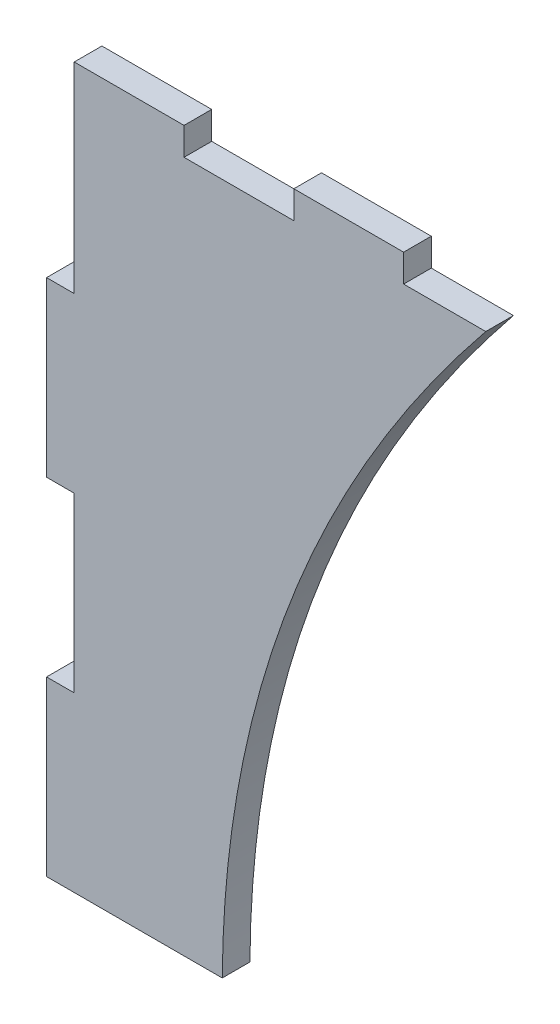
ISO-10303-21;
HEADER;
FILE_DESCRIPTION(('STEP AP214'),'2;1');
FILE_NAME('part.step','',(''),(''),'','','');
FILE_SCHEMA(('AUTOMOTIVE_DESIGN { 1 0 10303 214 1 1 1 1 }'));
ENDSEC;
DATA;
#1=APPLICATION_CONTEXT('core data for automotive mechanical design processes');
#2=APPLICATION_PROTOCOL_DEFINITION('international standard','automotive_design',2000,#1);
#3=PRODUCT_CONTEXT('',#1,'mechanical');
#4=PRODUCT('Part','Part','',(#3));
#5=PRODUCT_RELATED_PRODUCT_CATEGORY('part','',(#4));
#6=PRODUCT_DEFINITION_FORMATION('','',#4);
#7=PRODUCT_DEFINITION_CONTEXT('part definition',#1,'design');
#8=PRODUCT_DEFINITION('design','',#6,#7);
#9=PRODUCT_DEFINITION_SHAPE('','',#8);
#10=(LENGTH_UNIT() NAMED_UNIT(*) SI_UNIT(.MILLI.,.METRE.));
#11=(NAMED_UNIT(*) PLANE_ANGLE_UNIT() SI_UNIT($,.RADIAN.));
#12=(NAMED_UNIT(*) SI_UNIT($,.STERADIAN.) SOLID_ANGLE_UNIT());
#13=UNCERTAINTY_MEASURE_WITH_UNIT(LENGTH_MEASURE(1.E-05),#10,'distance_accuracy_value','');
#14=(GEOMETRIC_REPRESENTATION_CONTEXT(3) GLOBAL_UNCERTAINTY_ASSIGNED_CONTEXT((#13)) GLOBAL_UNIT_ASSIGNED_CONTEXT((#10,
#11,#12)) REPRESENTATION_CONTEXT('',''));
#15=CARTESIAN_POINT('',(0.,0.,0.));
#16=DIRECTION('',(0.,0.,1.));
#17=DIRECTION('',(1.,0.,0.));
#18=AXIS2_PLACEMENT_3D('',#15,#16,#17);
#19=CARTESIAN_POINT('',(0.,100.,16.));
#20=DIRECTION('',(1.,0.,0.));
#21=DIRECTION('',(0.,0.,-1.));
#22=AXIS2_PLACEMENT_3D('',#19,#20,#21);
#23=PLANE('',#22);
#24=DIRECTION('',(0.,-1.,0.));
#25=VECTOR('',#24,1.);
#26=CARTESIAN_POINT('',(0.,100.,0.));
#27=LINE('',#26,#25);
#28=CARTESIAN_POINT('',(0.,100.,0.));
#29=VERTEX_POINT('',#28);
#30=CARTESIAN_POINT('',(0.,0.,0.));
#31=VERTEX_POINT('',#30);
#32=EDGE_CURVE('E177',#29,#31,#27,.T.);
#33=ORIENTED_EDGE('',*,*,#32,.T.);
#34=DIRECTION('',(0.,0.,-1.));
#35=VECTOR('',#34,1.);
#36=CARTESIAN_POINT('',(0.,0.,16.));
#37=LINE('',#36,#35);
#38=CARTESIAN_POINT('',(0.,0.,16.));
#39=VERTEX_POINT('',#38);
#40=EDGE_CURVE('E11',#39,#31,#37,.T.);
#41=ORIENTED_EDGE('',*,*,#40,.F.);
#42=DIRECTION('',(0.,-1.,0.));
#43=VECTOR('',#42,1.);
#44=CARTESIAN_POINT('',(0.,100.,16.));
#45=LINE('',#44,#43);
#46=CARTESIAN_POINT('',(0.,100.,16.));
#47=VERTEX_POINT('',#46);
#48=EDGE_CURVE('E212',#47,#39,#45,.T.);
#49=ORIENTED_EDGE('',*,*,#48,.F.);
#50=DIRECTION('',(0.,0.,-1.));
#51=VECTOR('',#50,1.);
#52=CARTESIAN_POINT('',(0.,100.,16.));
#53=LINE('',#52,#51);
#54=EDGE_CURVE('E173',#47,#29,#53,.T.);
#55=ORIENTED_EDGE('',*,*,#54,.T.);
#56=EDGE_LOOP('',(#33,#41,#49,#55));
#57=FACE_BOUND('',#56,.T.);
#58=ADVANCED_FACE('F33',(#57),#23,.F.);
#59=CARTESIAN_POINT('',(0.,0.,16.));
#60=DIRECTION('',(0.,1.,0.));
#61=DIRECTION('',(0.,0.,1.));
#62=AXIS2_PLACEMENT_3D('',#59,#60,#61);
#63=PLANE('',#62);
#64=DIRECTION('',(1.,0.,0.));
#65=VECTOR('',#64,1.);
#66=CARTESIAN_POINT('',(0.,0.,0.));
#67=LINE('',#66,#65);
#68=CARTESIAN_POINT('',(101.6,0.,0.));
#69=VERTEX_POINT('',#68);
#70=EDGE_CURVE('E180',#31,#69,#67,.T.);
#71=ORIENTED_EDGE('',*,*,#70,.T.);
#72=DIRECTION('',(0.,0.,-1.));
#73=VECTOR('',#72,1.);
#74=CARTESIAN_POINT('',(101.6,0.,16.));
#75=LINE('',#74,#73);
#76=CARTESIAN_POINT('',(101.6,0.,16.));
#77=VERTEX_POINT('',#76);
#78=EDGE_CURVE('E41',#77,#69,#75,.T.);
#79=ORIENTED_EDGE('',*,*,#78,.F.);
#80=DIRECTION('',(1.,0.,0.));
#81=VECTOR('',#80,1.);
#82=CARTESIAN_POINT('',(0.,0.,16.));
#83=LINE('',#82,#81);
#84=EDGE_CURVE('E116',#39,#77,#83,.T.);
#85=ORIENTED_EDGE('',*,*,#84,.F.);
#86=ORIENTED_EDGE('',*,*,#40,.T.);
#87=EDGE_LOOP('',(#71,#79,#85,#86));
#88=FACE_BOUND('',#87,.T.);
#89=ADVANCED_FACE('F310',(#88),#63,.F.);
#90=CARTESIAN_POINT('',(101.6,0.,16.));
#91=CARTESIAN_POINT('',(103.225203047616,213.725277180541,16.));
#92=CARTESIAN_POINT('',(254.,400.,16.));
#93=B_SPLINE_CURVE_WITH_KNOTS('',2,(#90,#91,#92),.UNSPECIFIED.,.F.,.F.,(3,3),(0.,
0.978671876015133),.UNSPECIFIED.);
#94=DIRECTION('',(0.,0.,-1.));
#95=VECTOR('',#94,1.);
#96=SURFACE_OF_LINEAR_EXTRUSION('',#93,#95);
#97=CARTESIAN_POINT('',(101.6,0.,0.));
#98=CARTESIAN_POINT('',(103.225203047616,213.725277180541,0.));
#99=CARTESIAN_POINT('',(254.,400.,0.));
#100=B_SPLINE_CURVE_WITH_KNOTS('',2,(#97,#98,#99),.UNSPECIFIED.,.F.,.F.,(3,3),(0.,
0.978671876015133),.UNSPECIFIED.);
#101=CARTESIAN_POINT('',(254.,400.,0.));
#102=VERTEX_POINT('',#101);
#103=EDGE_CURVE('E182',#69,#102,#100,.T.);
#104=ORIENTED_EDGE('',*,*,#103,.T.);
#105=DIRECTION('',(0.,0.,-1.));
#106=VECTOR('',#105,1.);
#107=CARTESIAN_POINT('',(254.,400.,16.));
#108=LINE('',#107,#106);
#109=CARTESIAN_POINT('',(254.,400.,16.));
#110=VERTEX_POINT('',#109);
#111=EDGE_CURVE('E243',#110,#102,#108,.T.);
#112=ORIENTED_EDGE('',*,*,#111,.F.);
#113=EDGE_CURVE('E251',#77,#110,#93,.T.);
#114=ORIENTED_EDGE('',*,*,#113,.F.);
#115=ORIENTED_EDGE('',*,*,#78,.T.);
#116=EDGE_LOOP('',(#104,#112,#114,#115));
#117=FACE_BOUND('',#116,.T.);
#118=ADVANCED_FACE('F249',(#117),#96,.F.);
#119=CARTESIAN_POINT('',(206.5,400.,16.));
#120=DIRECTION('',(0.,-1.,0.));
#121=DIRECTION('',(0.,0.,-1.));
#122=AXIS2_PLACEMENT_3D('',#119,#120,#121);
#123=PLANE('',#122);
#124=DIRECTION('',(-1.,0.,0.));
#125=VECTOR('',#124,1.);
#126=CARTESIAN_POINT('',(206.5,400.,0.));
#127=LINE('',#126,#125);
#128=CARTESIAN_POINT('',(206.5,400.,0.));
#129=VERTEX_POINT('',#128);
#130=EDGE_CURVE('E186',#102,#129,#127,.T.);
#131=ORIENTED_EDGE('',*,*,#130,.T.);
#132=DIRECTION('',(0.,0.,-1.));
#133=VECTOR('',#132,1.);
#134=CARTESIAN_POINT('',(206.5,400.,16.));
#135=LINE('',#134,#133);
#136=CARTESIAN_POINT('',(206.5,400.,16.));
#137=VERTEX_POINT('',#136);
#138=EDGE_CURVE('E240',#137,#129,#135,.T.);
#139=ORIENTED_EDGE('',*,*,#138,.F.);
#140=DIRECTION('',(-1.,0.,0.));
#141=VECTOR('',#140,1.);
#142=CARTESIAN_POINT('',(206.5,400.,16.));
#143=LINE('',#142,#141);
#144=EDGE_CURVE('E269',#110,#137,#143,.T.);
#145=ORIENTED_EDGE('',*,*,#144,.F.);
#146=ORIENTED_EDGE('',*,*,#111,.T.);
#147=EDGE_LOOP('',(#131,#139,#145,#146));
#148=FACE_BOUND('',#147,.T.);
#149=ADVANCED_FACE('F260',(#148),#123,.F.);
#150=CARTESIAN_POINT('',(206.5,416.,16.));
#151=DIRECTION('',(-1.,0.,0.));
#152=DIRECTION('',(0.,-1.,0.));
#153=AXIS2_PLACEMENT_3D('',#150,#151,#152);
#154=PLANE('',#153);
#155=DIRECTION('',(0.,1.,0.));
#156=VECTOR('',#155,1.);
#157=CARTESIAN_POINT('',(206.5,416.,0.));
#158=LINE('',#157,#156);
#159=CARTESIAN_POINT('',(206.5,416.,0.));
#160=VERTEX_POINT('',#159);
#161=EDGE_CURVE('E191',#129,#160,#158,.T.);
#162=ORIENTED_EDGE('',*,*,#161,.T.);
#163=DIRECTION('',(0.,0.,-1.));
#164=VECTOR('',#163,1.);
#165=CARTESIAN_POINT('',(206.5,416.,16.));
#166=LINE('',#165,#164);
#167=CARTESIAN_POINT('',(206.5,416.,16.));
#168=VERTEX_POINT('',#167);
#169=EDGE_CURVE('E237',#168,#160,#166,.T.);
#170=ORIENTED_EDGE('',*,*,#169,.F.);
#171=DIRECTION('',(0.,1.,0.));
#172=VECTOR('',#171,1.);
#173=CARTESIAN_POINT('',(206.5,416.,16.));
#174=LINE('',#173,#172);
#175=EDGE_CURVE('E266',#137,#168,#174,.T.);
#176=ORIENTED_EDGE('',*,*,#175,.F.);
#177=ORIENTED_EDGE('',*,*,#138,.T.);
#178=EDGE_LOOP('',(#162,#170,#176,#177));
#179=FACE_BOUND('',#178,.T.);
#180=ADVANCED_FACE('F264',(#179),#154,.F.);
#181=CARTESIAN_POINT('',(143.,416.,16.));
#182=DIRECTION('',(0.,-1.,0.));
#183=DIRECTION('',(0.,0.,-1.));
#184=AXIS2_PLACEMENT_3D('',#181,#182,#183);
#185=PLANE('',#184);
#186=DIRECTION('',(-1.,0.,0.));
#187=VECTOR('',#186,1.);
#188=CARTESIAN_POINT('',(143.,416.,0.));
#189=LINE('',#188,#187);
#190=CARTESIAN_POINT('',(143.,416.,0.));
#191=VERTEX_POINT('',#190);
#192=EDGE_CURVE('E193',#160,#191,#189,.T.);
#193=ORIENTED_EDGE('',*,*,#192,.T.);
#194=DIRECTION('',(0.,0.,-1.));
#195=VECTOR('',#194,1.);
#196=CARTESIAN_POINT('',(143.,416.,16.));
#197=LINE('',#196,#195);
#198=CARTESIAN_POINT('',(143.,416.,16.));
#199=VERTEX_POINT('',#198);
#200=EDGE_CURVE('E234',#199,#191,#197,.T.);
#201=ORIENTED_EDGE('',*,*,#200,.F.);
#202=DIRECTION('',(-1.,0.,0.));
#203=VECTOR('',#202,1.);
#204=CARTESIAN_POINT('',(143.,416.,16.));
#205=LINE('',#204,#203);
#206=EDGE_CURVE('E268',#168,#199,#205,.T.);
#207=ORIENTED_EDGE('',*,*,#206,.F.);
#208=ORIENTED_EDGE('',*,*,#169,.T.);
#209=EDGE_LOOP('',(#193,#201,#207,#208));
#210=FACE_BOUND('',#209,.T.);
#211=ADVANCED_FACE('F331',(#210),#185,.F.);
#212=CARTESIAN_POINT('',(143.,400.,16.));
#213=DIRECTION('',(1.,0.,0.));
#214=DIRECTION('',(0.,0.,-1.));
#215=AXIS2_PLACEMENT_3D('',#212,#213,#214);
#216=PLANE('',#215);
#217=DIRECTION('',(0.,-1.,0.));
#218=VECTOR('',#217,1.);
#219=CARTESIAN_POINT('',(143.,400.,0.));
#220=LINE('',#219,#218);
#221=CARTESIAN_POINT('',(143.,400.,0.));
#222=VERTEX_POINT('',#221);
#223=EDGE_CURVE('E195',#191,#222,#220,.T.);
#224=ORIENTED_EDGE('',*,*,#223,.T.);
#225=DIRECTION('',(0.,0.,-1.));
#226=VECTOR('',#225,1.);
#227=CARTESIAN_POINT('',(143.,400.,16.));
#228=LINE('',#227,#226);
#229=CARTESIAN_POINT('',(143.,400.,16.));
#230=VERTEX_POINT('',#229);
#231=EDGE_CURVE('E231',#230,#222,#228,.T.);
#232=ORIENTED_EDGE('',*,*,#231,.F.);
#233=DIRECTION('',(0.,-1.,0.));
#234=VECTOR('',#233,1.);
#235=CARTESIAN_POINT('',(143.,400.,16.));
#236=LINE('',#235,#234);
#237=EDGE_CURVE('E271',#199,#230,#236,.T.);
#238=ORIENTED_EDGE('',*,*,#237,.F.);
#239=ORIENTED_EDGE('',*,*,#200,.T.);
#240=EDGE_LOOP('',(#224,#232,#238,#239));
#241=FACE_BOUND('',#240,.T.);
#242=ADVANCED_FACE('F334',(#241),#216,.F.);
#243=CARTESIAN_POINT('',(79.5,400.,16.));
#244=DIRECTION('',(0.,-1.,0.));
#245=DIRECTION('',(0.,0.,-1.));
#246=AXIS2_PLACEMENT_3D('',#243,#244,#245);
#247=PLANE('',#246);
#248=DIRECTION('',(-1.,0.,0.));
#249=VECTOR('',#248,1.);
#250=CARTESIAN_POINT('',(79.5,400.,0.));
#251=LINE('',#250,#249);
#252=CARTESIAN_POINT('',(79.5,400.,0.));
#253=VERTEX_POINT('',#252);
#254=EDGE_CURVE('E197',#222,#253,#251,.T.);
#255=ORIENTED_EDGE('',*,*,#254,.T.);
#256=DIRECTION('',(0.,0.,-1.));
#257=VECTOR('',#256,1.);
#258=CARTESIAN_POINT('',(79.5,400.,16.));
#259=LINE('',#258,#257);
#260=CARTESIAN_POINT('',(79.5,400.,16.));
#261=VERTEX_POINT('',#260);
#262=EDGE_CURVE('E228',#261,#253,#259,.T.);
#263=ORIENTED_EDGE('',*,*,#262,.F.);
#264=DIRECTION('',(-1.,0.,0.));
#265=VECTOR('',#264,1.);
#266=CARTESIAN_POINT('',(79.5,400.,16.));
#267=LINE('',#266,#265);
#268=EDGE_CURVE('E277',#230,#261,#267,.T.);
#269=ORIENTED_EDGE('',*,*,#268,.F.);
#270=ORIENTED_EDGE('',*,*,#231,.T.);
#271=EDGE_LOOP('',(#255,#263,#269,#270));
#272=FACE_BOUND('',#271,.T.);
#273=ADVANCED_FACE('F338',(#272),#247,.F.);
#274=CARTESIAN_POINT('',(79.5,416.,16.));
#275=DIRECTION('',(-1.,0.,0.));
#276=DIRECTION('',(0.,0.,1.));
#277=AXIS2_PLACEMENT_3D('',#274,#275,#276);
#278=PLANE('',#277);
#279=DIRECTION('',(0.,1.,0.));
#280=VECTOR('',#279,1.);
#281=CARTESIAN_POINT('',(79.5,416.,0.));
#282=LINE('',#281,#280);
#283=CARTESIAN_POINT('',(79.5,416.,0.));
#284=VERTEX_POINT('',#283);
#285=EDGE_CURVE('E199',#253,#284,#282,.T.);
#286=ORIENTED_EDGE('',*,*,#285,.T.);
#287=DIRECTION('',(0.,0.,-1.));
#288=VECTOR('',#287,1.);
#289=CARTESIAN_POINT('',(79.5,416.,16.));
#290=LINE('',#289,#288);
#291=CARTESIAN_POINT('',(79.5,416.,16.));
#292=VERTEX_POINT('',#291);
#293=EDGE_CURVE('E225',#292,#284,#290,.T.);
#294=ORIENTED_EDGE('',*,*,#293,.F.);
#295=DIRECTION('',(0.,1.,0.));
#296=VECTOR('',#295,1.);
#297=CARTESIAN_POINT('',(79.5,416.,16.));
#298=LINE('',#297,#296);
#299=EDGE_CURVE('E279',#261,#292,#298,.T.);
#300=ORIENTED_EDGE('',*,*,#299,.F.);
#301=ORIENTED_EDGE('',*,*,#262,.T.);
#302=EDGE_LOOP('',(#286,#294,#300,#301));
#303=FACE_BOUND('',#302,.T.);
#304=ADVANCED_FACE('F342',(#303),#278,.F.);
#305=CARTESIAN_POINT('',(79.5,416.,16.));
#306=DIRECTION('',(0.,-1.,0.));
#307=DIRECTION('',(0.,0.,-1.));
#308=AXIS2_PLACEMENT_3D('',#305,#306,#307);
#309=PLANE('',#308);
#310=DIRECTION('',(-1.,0.,0.));
#311=VECTOR('',#310,1.);
#312=CARTESIAN_POINT('',(79.5,416.,0.));
#313=LINE('',#312,#311);
#314=CARTESIAN_POINT('',(16.,416.,0.));
#315=VERTEX_POINT('',#314);
#316=EDGE_CURVE('E201',#284,#315,#313,.T.);
#317=ORIENTED_EDGE('',*,*,#316,.T.);
#318=DIRECTION('',(0.,0.,-1.));
#319=VECTOR('',#318,1.);
#320=CARTESIAN_POINT('',(16.,416.,16.));
#321=LINE('',#320,#319);
#322=CARTESIAN_POINT('',(16.,416.,16.));
#323=VERTEX_POINT('',#322);
#324=EDGE_CURVE('E222',#323,#315,#321,.T.);
#325=ORIENTED_EDGE('',*,*,#324,.F.);
#326=DIRECTION('',(-1.,0.,0.));
#327=VECTOR('',#326,1.);
#328=CARTESIAN_POINT('',(79.5,416.,16.));
#329=LINE('',#328,#327);
#330=EDGE_CURVE('E281',#292,#323,#329,.T.);
#331=ORIENTED_EDGE('',*,*,#330,.F.);
#332=ORIENTED_EDGE('',*,*,#293,.T.);
#333=EDGE_LOOP('',(#317,#325,#331,#332));
#334=FACE_BOUND('',#333,.T.);
#335=ADVANCED_FACE('F346',(#334),#309,.F.);
#336=CARTESIAN_POINT('',(16.,300.,16.));
#337=DIRECTION('',(1.,0.,0.));
#338=DIRECTION('',(0.,1.,0.));
#339=AXIS2_PLACEMENT_3D('',#336,#337,#338);
#340=PLANE('',#339);
#341=DIRECTION('',(0.,-1.,0.));
#342=VECTOR('',#341,1.);
#343=CARTESIAN_POINT('',(16.,300.,0.));
#344=LINE('',#343,#342);
#345=CARTESIAN_POINT('',(16.,300.,0.));
#346=VERTEX_POINT('',#345);
#347=EDGE_CURVE('E203',#315,#346,#344,.T.);
#348=ORIENTED_EDGE('',*,*,#347,.T.);
#349=DIRECTION('',(0.,0.,-1.));
#350=VECTOR('',#349,1.);
#351=CARTESIAN_POINT('',(16.,300.,16.));
#352=LINE('',#351,#350);
#353=CARTESIAN_POINT('',(16.,300.,16.));
#354=VERTEX_POINT('',#353);
#355=EDGE_CURVE('E219',#354,#346,#352,.T.);
#356=ORIENTED_EDGE('',*,*,#355,.F.);
#357=DIRECTION('',(0.,-1.,0.));
#358=VECTOR('',#357,1.);
#359=CARTESIAN_POINT('',(16.,300.,16.));
#360=LINE('',#359,#358);
#361=EDGE_CURVE('E283',#323,#354,#360,.T.);
#362=ORIENTED_EDGE('',*,*,#361,.F.);
#363=ORIENTED_EDGE('',*,*,#324,.T.);
#364=EDGE_LOOP('',(#348,#356,#362,#363));
#365=FACE_BOUND('',#364,.T.);
#366=ADVANCED_FACE('F350',(#365),#340,.F.);
#367=CARTESIAN_POINT('',(0.,300.,16.));
#368=DIRECTION('',(0.,-1.,0.));
#369=DIRECTION('',(0.,0.,-1.));
#370=AXIS2_PLACEMENT_3D('',#367,#368,#369);
#371=PLANE('',#370);
#372=DIRECTION('',(-1.,0.,0.));
#373=VECTOR('',#372,1.);
#374=CARTESIAN_POINT('',(0.,300.,0.));
#375=LINE('',#374,#373);
#376=CARTESIAN_POINT('',(0.,300.,0.));
#377=VERTEX_POINT('',#376);
#378=EDGE_CURVE('E205',#346,#377,#375,.T.);
#379=ORIENTED_EDGE('',*,*,#378,.T.);
#380=DIRECTION('',(0.,0.,-1.));
#381=VECTOR('',#380,1.);
#382=CARTESIAN_POINT('',(0.,300.,16.));
#383=LINE('',#382,#381);
#384=CARTESIAN_POINT('',(0.,300.,16.));
#385=VERTEX_POINT('',#384);
#386=EDGE_CURVE('E216',#385,#377,#383,.T.);
#387=ORIENTED_EDGE('',*,*,#386,.F.);
#388=DIRECTION('',(-1.,0.,0.));
#389=VECTOR('',#388,1.);
#390=CARTESIAN_POINT('',(0.,300.,16.));
#391=LINE('',#390,#389);
#392=EDGE_CURVE('E285',#354,#385,#391,.T.);
#393=ORIENTED_EDGE('',*,*,#392,.F.);
#394=ORIENTED_EDGE('',*,*,#355,.T.);
#395=EDGE_LOOP('',(#379,#387,#393,#394));
#396=FACE_BOUND('',#395,.T.);
#397=ADVANCED_FACE('F291',(#396),#371,.F.);
#398=CARTESIAN_POINT('',(0.,300.,16.));
#399=DIRECTION('',(1.,0.,0.));
#400=DIRECTION('',(0.,0.,-1.));
#401=AXIS2_PLACEMENT_3D('',#398,#399,#400);
#402=PLANE('',#401);
#403=DIRECTION('',(0.,-1.,0.));
#404=VECTOR('',#403,1.);
#405=CARTESIAN_POINT('',(0.,300.,0.));
#406=LINE('',#405,#404);
#407=CARTESIAN_POINT('',(0.,200.,0.));
#408=VERTEX_POINT('',#407);
#409=EDGE_CURVE('E207',#377,#408,#406,.T.);
#410=ORIENTED_EDGE('',*,*,#409,.T.);
#411=DIRECTION('',(0.,0.,-1.));
#412=VECTOR('',#411,1.);
#413=CARTESIAN_POINT('',(0.,200.,16.));
#414=LINE('',#413,#412);
#415=CARTESIAN_POINT('',(0.,200.,16.));
#416=VERTEX_POINT('',#415);
#417=EDGE_CURVE('E168',#416,#408,#414,.T.);
#418=ORIENTED_EDGE('',*,*,#417,.F.);
#419=DIRECTION('',(0.,-1.,0.));
#420=VECTOR('',#419,1.);
#421=CARTESIAN_POINT('',(0.,300.,16.));
#422=LINE('',#421,#420);
#423=EDGE_CURVE('E159',#385,#416,#422,.T.);
#424=ORIENTED_EDGE('',*,*,#423,.F.);
#425=ORIENTED_EDGE('',*,*,#386,.T.);
#426=EDGE_LOOP('',(#410,#418,#424,#425));
#427=FACE_BOUND('',#426,.T.);
#428=ADVANCED_FACE('F295',(#427),#402,.F.);
#429=CARTESIAN_POINT('',(16.,200.,16.));
#430=DIRECTION('',(0.,1.,0.));
#431=DIRECTION('',(-1.,0.,0.));
#432=AXIS2_PLACEMENT_3D('',#429,#430,#431);
#433=PLANE('',#432);
#434=DIRECTION('',(1.,0.,0.));
#435=VECTOR('',#434,1.);
#436=CARTESIAN_POINT('',(16.,200.,0.));
#437=LINE('',#436,#435);
#438=CARTESIAN_POINT('',(16.,200.,0.));
#439=VERTEX_POINT('',#438);
#440=EDGE_CURVE('E167',#408,#439,#437,.T.);
#441=ORIENTED_EDGE('',*,*,#440,.T.);
#442=DIRECTION('',(0.,0.,-1.));
#443=VECTOR('',#442,1.);
#444=CARTESIAN_POINT('',(16.,200.,16.));
#445=LINE('',#444,#443);
#446=CARTESIAN_POINT('',(16.,200.,16.));
#447=VERTEX_POINT('',#446);
#448=EDGE_CURVE('E164',#447,#439,#445,.T.);
#449=ORIENTED_EDGE('',*,*,#448,.F.);
#450=DIRECTION('',(1.,0.,0.));
#451=VECTOR('',#450,1.);
#452=CARTESIAN_POINT('',(16.,200.,16.));
#453=LINE('',#452,#451);
#454=EDGE_CURVE('E153',#416,#447,#453,.T.);
#455=ORIENTED_EDGE('',*,*,#454,.F.);
#456=ORIENTED_EDGE('',*,*,#417,.T.);
#457=EDGE_LOOP('',(#441,#449,#455,#456));
#458=FACE_BOUND('',#457,.T.);
#459=ADVANCED_FACE('F165',(#458),#433,.F.);
#460=CARTESIAN_POINT('',(16.,100.,16.));
#461=DIRECTION('',(1.,0.,0.));
#462=DIRECTION('',(0.,0.,-1.));
#463=AXIS2_PLACEMENT_3D('',#460,#461,#462);
#464=PLANE('',#463);
#465=DIRECTION('',(0.,-1.,0.));
#466=VECTOR('',#465,1.);
#467=CARTESIAN_POINT('',(16.,100.,0.));
#468=LINE('',#467,#466);
#469=CARTESIAN_POINT('',(16.,100.,0.));
#470=VERTEX_POINT('',#469);
#471=EDGE_CURVE('E102',#439,#470,#468,.T.);
#472=ORIENTED_EDGE('',*,*,#471,.T.);
#473=DIRECTION('',(0.,0.,-1.));
#474=VECTOR('',#473,1.);
#475=CARTESIAN_POINT('',(16.,100.,16.));
#476=LINE('',#475,#474);
#477=CARTESIAN_POINT('',(16.,100.,16.));
#478=VERTEX_POINT('',#477);
#479=EDGE_CURVE('E169',#478,#470,#476,.T.);
#480=ORIENTED_EDGE('',*,*,#479,.F.);
#481=DIRECTION('',(0.,-1.,0.));
#482=VECTOR('',#481,1.);
#483=CARTESIAN_POINT('',(16.,100.,16.));
#484=LINE('',#483,#482);
#485=EDGE_CURVE('E157',#447,#478,#484,.T.);
#486=ORIENTED_EDGE('',*,*,#485,.F.);
#487=ORIENTED_EDGE('',*,*,#448,.T.);
#488=EDGE_LOOP('',(#472,#480,#486,#487));
#489=FACE_BOUND('',#488,.T.);
#490=ADVANCED_FACE('F171',(#489),#464,.F.);
#491=CARTESIAN_POINT('',(0.,100.,16.));
#492=DIRECTION('',(0.,-1.,0.));
#493=DIRECTION('',(0.,0.,-1.));
#494=AXIS2_PLACEMENT_3D('',#491,#492,#493);
#495=PLANE('',#494);
#496=DIRECTION('',(-1.,0.,0.));
#497=VECTOR('',#496,1.);
#498=CARTESIAN_POINT('',(0.,100.,0.));
#499=LINE('',#498,#497);
#500=EDGE_CURVE('E108',#470,#29,#499,.T.);
#501=ORIENTED_EDGE('',*,*,#500,.T.);
#502=ORIENTED_EDGE('',*,*,#54,.F.);
#503=DIRECTION('',(-1.,0.,0.));
#504=VECTOR('',#503,1.);
#505=CARTESIAN_POINT('',(0.,100.,16.));
#506=LINE('',#505,#504);
#507=EDGE_CURVE('E49',#478,#47,#506,.T.);
#508=ORIENTED_EDGE('',*,*,#507,.F.);
#509=ORIENTED_EDGE('',*,*,#479,.T.);
#510=EDGE_LOOP('',(#501,#502,#508,#509));
#511=FACE_BOUND('',#510,.T.);
#512=ADVANCED_FACE('F299',(#511),#495,.F.);
#513=CARTESIAN_POINT('',(140.512601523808,206.862638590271,16.));
#514=DIRECTION('',(0.,0.,-1.));
#515=DIRECTION('',(-1.,0.,0.));
#516=AXIS2_PLACEMENT_3D('',#513,#514,#515);
#517=PLANE('',#516);
#518=ORIENTED_EDGE('',*,*,#48,.T.);
#519=ORIENTED_EDGE('',*,*,#84,.T.);
#520=ORIENTED_EDGE('',*,*,#113,.T.);
#521=ORIENTED_EDGE('',*,*,#144,.T.);
#522=ORIENTED_EDGE('',*,*,#175,.T.);
#523=ORIENTED_EDGE('',*,*,#206,.T.);
#524=ORIENTED_EDGE('',*,*,#237,.T.);
#525=ORIENTED_EDGE('',*,*,#268,.T.);
#526=ORIENTED_EDGE('',*,*,#299,.T.);
#527=ORIENTED_EDGE('',*,*,#330,.T.);
#528=ORIENTED_EDGE('',*,*,#361,.T.);
#529=ORIENTED_EDGE('',*,*,#392,.T.);
#530=ORIENTED_EDGE('',*,*,#423,.T.);
#531=ORIENTED_EDGE('',*,*,#454,.T.);
#532=ORIENTED_EDGE('',*,*,#485,.T.);
#533=ORIENTED_EDGE('',*,*,#507,.T.);
#534=EDGE_LOOP('',(#518,#519,#520,#521,#522,#523,#524,#525,#526,#527,#528,#529,#530,#531,#532,#533));
#535=FACE_BOUND('',#534,.T.);
#536=ADVANCED_FACE('F155',(#535),#517,.F.);
#537=CARTESIAN_POINT('',(140.512601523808,206.862638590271,0.));
#538=DIRECTION('',(0.,0.,-1.));
#539=DIRECTION('',(-1.,0.,0.));
#540=AXIS2_PLACEMENT_3D('',#537,#538,#539);
#541=PLANE('',#540);
#542=ORIENTED_EDGE('',*,*,#32,.F.);
#543=ORIENTED_EDGE('',*,*,#500,.F.);
#544=ORIENTED_EDGE('',*,*,#471,.F.);
#545=ORIENTED_EDGE('',*,*,#440,.F.);
#546=ORIENTED_EDGE('',*,*,#409,.F.);
#547=ORIENTED_EDGE('',*,*,#378,.F.);
#548=ORIENTED_EDGE('',*,*,#347,.F.);
#549=ORIENTED_EDGE('',*,*,#316,.F.);
#550=ORIENTED_EDGE('',*,*,#285,.F.);
#551=ORIENTED_EDGE('',*,*,#254,.F.);
#552=ORIENTED_EDGE('',*,*,#223,.F.);
#553=ORIENTED_EDGE('',*,*,#192,.F.);
#554=ORIENTED_EDGE('',*,*,#161,.F.);
#555=ORIENTED_EDGE('',*,*,#130,.F.);
#556=ORIENTED_EDGE('',*,*,#103,.F.);
#557=ORIENTED_EDGE('',*,*,#70,.F.);
#558=EDGE_LOOP('',(#542,#543,#544,#545,#546,#547,#548,#549,#550,#551,#552,#553,#554,#555,#556,#557));
#559=FACE_BOUND('',#558,.T.);
#560=ADVANCED_FACE('F255',(#559),#541,.T.);
#561=CLOSED_SHELL('',(#58,#89,#118,#149,#180,#211,#242,#273,#304,#335,#366,#397,#428,#459,#490,
#512,#536,#560));
#562=MANIFOLD_SOLID_BREP('B2',#561);
#563=ADVANCED_BREP_SHAPE_REPRESENTATION('',(#18,#562),#14);
#564=SHAPE_DEFINITION_REPRESENTATION(#9,#563);
ENDSEC;
END-ISO-10303-21;
